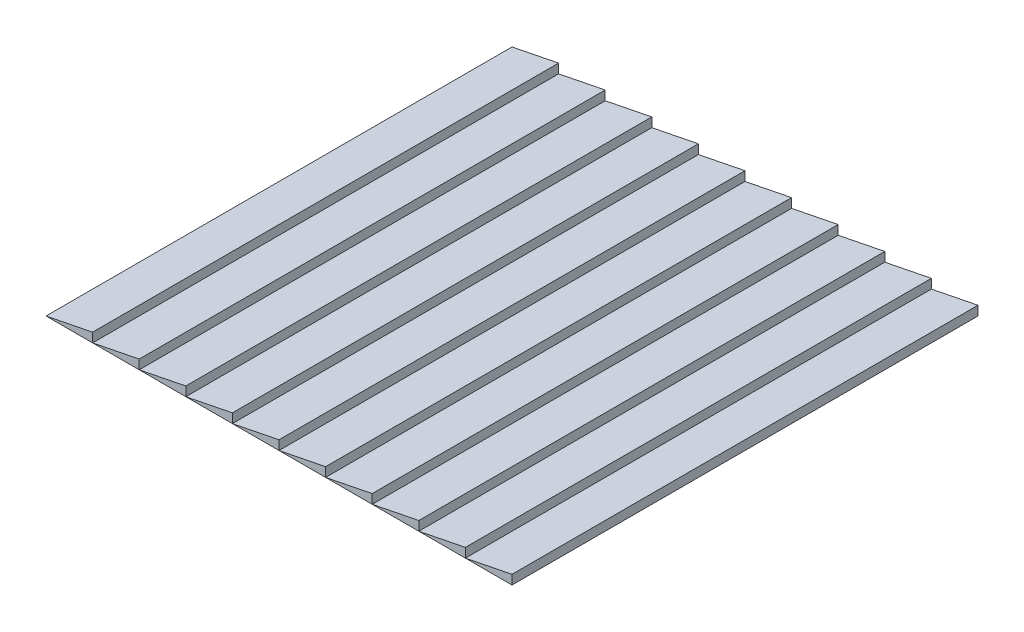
ISO-10303-21;
HEADER;
FILE_DESCRIPTION(('STEP AP214'),'2;1');
FILE_NAME('part.step','',(''),(''),'','','');
FILE_SCHEMA(('AUTOMOTIVE_DESIGN { 1 0 10303 214 1 1 1 1 }'));
ENDSEC;
DATA;
#1=APPLICATION_CONTEXT('core data for automotive mechanical design processes');
#2=APPLICATION_PROTOCOL_DEFINITION('international standard','automotive_design',2000,#1);
#3=PRODUCT_CONTEXT('',#1,'mechanical');
#4=PRODUCT('Part','Part','',(#3));
#5=PRODUCT_RELATED_PRODUCT_CATEGORY('part','',(#4));
#6=PRODUCT_DEFINITION_FORMATION('','',#4);
#7=PRODUCT_DEFINITION_CONTEXT('part definition',#1,'design');
#8=PRODUCT_DEFINITION('design','',#6,#7);
#9=PRODUCT_DEFINITION_SHAPE('','',#8);
#10=(LENGTH_UNIT() NAMED_UNIT(*) SI_UNIT(.MILLI.,.METRE.));
#11=(NAMED_UNIT(*) PLANE_ANGLE_UNIT() SI_UNIT($,.RADIAN.));
#12=(NAMED_UNIT(*) SI_UNIT($,.STERADIAN.) SOLID_ANGLE_UNIT());
#13=UNCERTAINTY_MEASURE_WITH_UNIT(LENGTH_MEASURE(1.E-05),#10,'distance_accuracy_value','');
#14=(GEOMETRIC_REPRESENTATION_CONTEXT(3) GLOBAL_UNCERTAINTY_ASSIGNED_CONTEXT((#13)) GLOBAL_UNIT_ASSIGNED_CONTEXT((#10,
#11,#12)) REPRESENTATION_CONTEXT('',''));
#15=CARTESIAN_POINT('',(0.,0.,0.));
#16=DIRECTION('',(0.,0.,1.));
#17=DIRECTION('',(1.,0.,0.));
#18=AXIS2_PLACEMENT_3D('',#15,#16,#17);
#19=CARTESIAN_POINT('',(-900.,-1.10218211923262E-13,-1000.));
#20=DIRECTION('',(1.,0.,0.));
#21=DIRECTION('',(0.,0.,-1.));
#22=AXIS2_PLACEMENT_3D('',#19,#20,#21);
#23=PLANE('',#22);
#24=DIRECTION('',(0.,1.,0.));
#25=VECTOR('',#24,1.);
#26=CARTESIAN_POINT('',(-900.,-1.10218211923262E-13,0.));
#27=LINE('',#26,#25);
#28=CARTESIAN_POINT('',(-900.,-1.10218211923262E-13,0.));
#29=VERTEX_POINT('',#28);
#30=CARTESIAN_POINT('',(-900.,19.9999999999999,0.));
#31=VERTEX_POINT('',#30);
#32=EDGE_CURVE('E102',#29,#31,#27,.T.);
#33=ORIENTED_EDGE('',*,*,#32,.F.);
#34=DIRECTION('',(0.,0.,1.));
#35=VECTOR('',#34,1.);
#36=CARTESIAN_POINT('',(-900.,-1.10218211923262E-13,-1000.));
#37=LINE('',#36,#35);
#38=CARTESIAN_POINT('',(-900.,-1.10218211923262E-13,-1000.));
#39=VERTEX_POINT('',#38);
#40=EDGE_CURVE('E12',#39,#29,#37,.T.);
#41=ORIENTED_EDGE('',*,*,#40,.F.);
#42=DIRECTION('',(0.,1.,0.));
#43=VECTOR('',#42,1.);
#44=CARTESIAN_POINT('',(-900.,-1.10218211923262E-13,-1000.));
#45=LINE('',#44,#43);
#46=CARTESIAN_POINT('',(-900.,19.9999999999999,-1000.));
#47=VERTEX_POINT('',#46);
#48=EDGE_CURVE('E95',#39,#47,#45,.T.);
#49=ORIENTED_EDGE('',*,*,#48,.T.);
#50=DIRECTION('',(0.,0.,1.));
#51=VECTOR('',#50,1.);
#52=CARTESIAN_POINT('',(-900.,19.9999999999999,-1000.));
#53=LINE('',#52,#51);
#54=EDGE_CURVE('E53',#47,#31,#53,.T.);
#55=ORIENTED_EDGE('',*,*,#54,.T.);
#56=EDGE_LOOP('',(#33,#41,#49,#55));
#57=FACE_BOUND('',#56,.T.);
#58=ADVANCED_FACE('F50',(#57),#23,.T.);
#59=CARTESIAN_POINT('',(-900.,-1.10218211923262E-13,-1000.));
#60=DIRECTION('',(0.,1.,0.));
#61=DIRECTION('',(-1.,0.,0.));
#62=AXIS2_PLACEMENT_3D('',#59,#60,#61);
#63=PLANE('',#62);
#64=DIRECTION('',(-1.,0.,0.));
#65=VECTOR('',#64,1.);
#66=CARTESIAN_POINT('',(-900.,-1.10218211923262E-13,0.));
#67=LINE('',#66,#65);
#68=CARTESIAN_POINT('',(-1000.,-1.22464679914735E-13,0.));
#69=VERTEX_POINT('',#68);
#70=EDGE_CURVE('E97',#29,#69,#67,.T.);
#71=ORIENTED_EDGE('',*,*,#70,.T.);
#72=DIRECTION('',(0.,0.,1.));
#73=VECTOR('',#72,1.);
#74=CARTESIAN_POINT('',(-1000.,-1.22464679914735E-13,-1000.));
#75=LINE('',#74,#73);
#76=CARTESIAN_POINT('',(-1000.,-1.22464679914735E-13,-1000.));
#77=VERTEX_POINT('',#76);
#78=EDGE_CURVE('E59',#77,#69,#75,.T.);
#79=ORIENTED_EDGE('',*,*,#78,.F.);
#80=DIRECTION('',(-1.,0.,0.));
#81=VECTOR('',#80,1.);
#82=CARTESIAN_POINT('',(-900.,-1.10218211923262E-13,-1000.));
#83=LINE('',#82,#81);
#84=EDGE_CURVE('E91',#39,#77,#83,.T.);
#85=ORIENTED_EDGE('',*,*,#84,.F.);
#86=ORIENTED_EDGE('',*,*,#40,.T.);
#87=EDGE_LOOP('',(#71,#79,#85,#86));
#88=FACE_BOUND('',#87,.T.);
#89=ADVANCED_FACE('F106',(#88),#63,.F.);
#90=CARTESIAN_POINT('',(-900.,19.9999999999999,-1000.));
#91=DIRECTION('',(-0.196116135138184,0.98058067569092,0.));
#92=DIRECTION('',(-0.98058067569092,-0.196116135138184,0.));
#93=AXIS2_PLACEMENT_3D('',#90,#91,#92);
#94=PLANE('',#93);
#95=DIRECTION('',(-0.98058067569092,-0.196116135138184,0.));
#96=VECTOR('',#95,1.);
#97=CARTESIAN_POINT('',(-900.,19.9999999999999,0.));
#98=LINE('',#97,#96);
#99=EDGE_CURVE('E89',#31,#69,#98,.T.);
#100=ORIENTED_EDGE('',*,*,#99,.F.);
#101=ORIENTED_EDGE('',*,*,#54,.F.);
#102=DIRECTION('',(-0.98058067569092,-0.196116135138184,0.));
#103=VECTOR('',#102,1.);
#104=CARTESIAN_POINT('',(-900.,19.9999999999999,-1000.));
#105=LINE('',#104,#103);
#106=EDGE_CURVE('E87',#47,#77,#105,.T.);
#107=ORIENTED_EDGE('',*,*,#106,.T.);
#108=ORIENTED_EDGE('',*,*,#78,.T.);
#109=EDGE_LOOP('',(#100,#101,#107,#108));
#110=FACE_BOUND('',#109,.T.);
#111=ADVANCED_FACE('F86',(#110),#94,.T.);
#112=CARTESIAN_POINT('',(-900.,-1.10218211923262E-13,-1000.));
#113=DIRECTION('',(0.,0.,1.));
#114=DIRECTION('',(1.,0.,0.));
#115=AXIS2_PLACEMENT_3D('',#112,#113,#114);
#116=PLANE('',#115);
#117=ORIENTED_EDGE('',*,*,#48,.F.);
#118=ORIENTED_EDGE('',*,*,#84,.T.);
#119=ORIENTED_EDGE('',*,*,#106,.F.);
#120=EDGE_LOOP('',(#117,#118,#119));
#121=FACE_BOUND('',#120,.T.);
#122=ADVANCED_FACE('F94',(#121),#116,.F.);
#123=CARTESIAN_POINT('',(-900.,-1.10218211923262E-13,0.));
#124=DIRECTION('',(0.,0.,1.));
#125=DIRECTION('',(1.,0.,0.));
#126=AXIS2_PLACEMENT_3D('',#123,#124,#125);
#127=PLANE('',#126);
#128=ORIENTED_EDGE('',*,*,#32,.T.);
#129=ORIENTED_EDGE('',*,*,#99,.T.);
#130=ORIENTED_EDGE('',*,*,#70,.F.);
#131=EDGE_LOOP('',(#128,#129,#130));
#132=FACE_BOUND('',#131,.T.);
#133=ADVANCED_FACE('F105',(#132),#127,.T.);
#134=CLOSED_SHELL('',(#58,#89,#111,#122,#133));
#135=MANIFOLD_SOLID_BREP('B2',#134);
#136=CARTESIAN_POINT('',(-800.,0.,-1000.));
#137=DIRECTION('',(1.,0.,0.));
#138=DIRECTION('',(0.,0.,-1.));
#139=AXIS2_PLACEMENT_3D('',#136,#137,#138);
#140=PLANE('',#139);
#141=DIRECTION('',(0.,1.,0.));
#142=VECTOR('',#141,1.);
#143=CARTESIAN_POINT('',(-800.,0.,0.));
#144=LINE('',#143,#142);
#145=CARTESIAN_POINT('',(-800.,0.,0.));
#146=VERTEX_POINT('',#145);
#147=CARTESIAN_POINT('',(-800.,19.9999999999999,0.));
#148=VERTEX_POINT('',#147);
#149=EDGE_CURVE('E230',#146,#148,#144,.T.);
#150=ORIENTED_EDGE('',*,*,#149,.F.);
#151=DIRECTION('',(0.,0.,1.));
#152=VECTOR('',#151,1.);
#153=CARTESIAN_POINT('',(-800.,0.,-1000.));
#154=LINE('',#153,#152);
#155=CARTESIAN_POINT('',(-800.,0.,-1000.));
#156=VERTEX_POINT('',#155);
#157=EDGE_CURVE('E48',#156,#146,#154,.T.);
#158=ORIENTED_EDGE('',*,*,#157,.F.);
#159=DIRECTION('',(0.,1.,0.));
#160=VECTOR('',#159,1.);
#161=CARTESIAN_POINT('',(-800.,0.,-1000.));
#162=LINE('',#161,#160);
#163=CARTESIAN_POINT('',(-800.,19.9999999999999,-1000.));
#164=VERTEX_POINT('',#163);
#165=EDGE_CURVE('E223',#156,#164,#162,.T.);
#166=ORIENTED_EDGE('',*,*,#165,.T.);
#167=DIRECTION('',(0.,0.,1.));
#168=VECTOR('',#167,1.);
#169=CARTESIAN_POINT('',(-800.,19.9999999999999,-1000.));
#170=LINE('',#169,#168);
#171=EDGE_CURVE('E181',#164,#148,#170,.T.);
#172=ORIENTED_EDGE('',*,*,#171,.T.);
#173=EDGE_LOOP('',(#150,#158,#166,#172));
#174=FACE_BOUND('',#173,.T.);
#175=ADVANCED_FACE('F178',(#174),#140,.T.);
#176=CARTESIAN_POINT('',(-800.,0.,-1000.));
#177=DIRECTION('',(0.,1.,0.));
#178=DIRECTION('',(-1.,0.,0.));
#179=AXIS2_PLACEMENT_3D('',#176,#177,#178);
#180=PLANE('',#179);
#181=DIRECTION('',(-1.,0.,0.));
#182=VECTOR('',#181,1.);
#183=CARTESIAN_POINT('',(-800.,0.,0.));
#184=LINE('',#183,#182);
#185=CARTESIAN_POINT('',(-900.,-1.10218211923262E-13,0.));
#186=VERTEX_POINT('',#185);
#187=EDGE_CURVE('E225',#146,#186,#184,.T.);
#188=ORIENTED_EDGE('',*,*,#187,.T.);
#189=DIRECTION('',(0.,0.,1.));
#190=VECTOR('',#189,1.);
#191=CARTESIAN_POINT('',(-900.,-1.10218211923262E-13,-1000.));
#192=LINE('',#191,#190);
#193=CARTESIAN_POINT('',(-900.,-1.10218211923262E-13,-1000.));
#194=VERTEX_POINT('',#193);
#195=EDGE_CURVE('E187',#194,#186,#192,.T.);
#196=ORIENTED_EDGE('',*,*,#195,.F.);
#197=DIRECTION('',(-1.,0.,0.));
#198=VECTOR('',#197,1.);
#199=CARTESIAN_POINT('',(-800.,0.,-1000.));
#200=LINE('',#199,#198);
#201=EDGE_CURVE('E219',#156,#194,#200,.T.);
#202=ORIENTED_EDGE('',*,*,#201,.F.);
#203=ORIENTED_EDGE('',*,*,#157,.T.);
#204=EDGE_LOOP('',(#188,#196,#202,#203));
#205=FACE_BOUND('',#204,.T.);
#206=ADVANCED_FACE('F234',(#205),#180,.F.);
#207=CARTESIAN_POINT('',(-800.,19.9999999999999,-1000.));
#208=DIRECTION('',(-0.196116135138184,0.98058067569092,0.));
#209=DIRECTION('',(-0.98058067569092,-0.196116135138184,0.));
#210=AXIS2_PLACEMENT_3D('',#207,#208,#209);
#211=PLANE('',#210);
#212=DIRECTION('',(-0.98058067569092,-0.196116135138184,0.));
#213=VECTOR('',#212,1.);
#214=CARTESIAN_POINT('',(-800.,19.9999999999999,0.));
#215=LINE('',#214,#213);
#216=EDGE_CURVE('E217',#148,#186,#215,.T.);
#217=ORIENTED_EDGE('',*,*,#216,.F.);
#218=ORIENTED_EDGE('',*,*,#171,.F.);
#219=DIRECTION('',(-0.98058067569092,-0.196116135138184,0.));
#220=VECTOR('',#219,1.);
#221=CARTESIAN_POINT('',(-800.,19.9999999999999,-1000.));
#222=LINE('',#221,#220);
#223=EDGE_CURVE('E215',#164,#194,#222,.T.);
#224=ORIENTED_EDGE('',*,*,#223,.T.);
#225=ORIENTED_EDGE('',*,*,#195,.T.);
#226=EDGE_LOOP('',(#217,#218,#224,#225));
#227=FACE_BOUND('',#226,.T.);
#228=ADVANCED_FACE('F214',(#227),#211,.T.);
#229=CARTESIAN_POINT('',(-800.,0.,-1000.));
#230=DIRECTION('',(0.,0.,1.));
#231=DIRECTION('',(1.,0.,0.));
#232=AXIS2_PLACEMENT_3D('',#229,#230,#231);
#233=PLANE('',#232);
#234=ORIENTED_EDGE('',*,*,#165,.F.);
#235=ORIENTED_EDGE('',*,*,#201,.T.);
#236=ORIENTED_EDGE('',*,*,#223,.F.);
#237=EDGE_LOOP('',(#234,#235,#236));
#238=FACE_BOUND('',#237,.T.);
#239=ADVANCED_FACE('F222',(#238),#233,.F.);
#240=CARTESIAN_POINT('',(-800.,0.,0.));
#241=DIRECTION('',(0.,0.,1.));
#242=DIRECTION('',(1.,0.,0.));
#243=AXIS2_PLACEMENT_3D('',#240,#241,#242);
#244=PLANE('',#243);
#245=ORIENTED_EDGE('',*,*,#149,.T.);
#246=ORIENTED_EDGE('',*,*,#216,.T.);
#247=ORIENTED_EDGE('',*,*,#187,.F.);
#248=EDGE_LOOP('',(#245,#246,#247));
#249=FACE_BOUND('',#248,.T.);
#250=ADVANCED_FACE('F233',(#249),#244,.T.);
#251=CLOSED_SHELL('',(#175,#206,#228,#239,#250));
#252=MANIFOLD_SOLID_BREP('B6',#251);
#253=CARTESIAN_POINT('',(-700.,0.,-1000.));
#254=DIRECTION('',(1.,0.,0.));
#255=DIRECTION('',(0.,0.,-1.));
#256=AXIS2_PLACEMENT_3D('',#253,#254,#255);
#257=PLANE('',#256);
#258=DIRECTION('',(0.,1.,0.));
#259=VECTOR('',#258,1.);
#260=CARTESIAN_POINT('',(-700.,0.,0.));
#261=LINE('',#260,#259);
#262=CARTESIAN_POINT('',(-700.,0.,0.));
#263=VERTEX_POINT('',#262);
#264=CARTESIAN_POINT('',(-700.,19.9999999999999,0.));
#265=VERTEX_POINT('',#264);
#266=EDGE_CURVE('E358',#263,#265,#261,.T.);
#267=ORIENTED_EDGE('',*,*,#266,.F.);
#268=DIRECTION('',(0.,0.,1.));
#269=VECTOR('',#268,1.);
#270=CARTESIAN_POINT('',(-700.,0.,-1000.));
#271=LINE('',#270,#269);
#272=CARTESIAN_POINT('',(-700.,0.,-1000.));
#273=VERTEX_POINT('',#272);
#274=EDGE_CURVE('E176',#273,#263,#271,.T.);
#275=ORIENTED_EDGE('',*,*,#274,.F.);
#276=DIRECTION('',(0.,1.,0.));
#277=VECTOR('',#276,1.);
#278=CARTESIAN_POINT('',(-700.,0.,-1000.));
#279=LINE('',#278,#277);
#280=CARTESIAN_POINT('',(-700.,19.9999999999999,-1000.));
#281=VERTEX_POINT('',#280);
#282=EDGE_CURVE('E351',#273,#281,#279,.T.);
#283=ORIENTED_EDGE('',*,*,#282,.T.);
#284=DIRECTION('',(0.,0.,1.));
#285=VECTOR('',#284,1.);
#286=CARTESIAN_POINT('',(-700.,19.9999999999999,-1000.));
#287=LINE('',#286,#285);
#288=EDGE_CURVE('E309',#281,#265,#287,.T.);
#289=ORIENTED_EDGE('',*,*,#288,.T.);
#290=EDGE_LOOP('',(#267,#275,#283,#289));
#291=FACE_BOUND('',#290,.T.);
#292=ADVANCED_FACE('F306',(#291),#257,.T.);
#293=CARTESIAN_POINT('',(-700.,0.,-1000.));
#294=DIRECTION('',(0.,1.,0.));
#295=DIRECTION('',(-1.,0.,0.));
#296=AXIS2_PLACEMENT_3D('',#293,#294,#295);
#297=PLANE('',#296);
#298=DIRECTION('',(-1.,0.,0.));
#299=VECTOR('',#298,1.);
#300=CARTESIAN_POINT('',(-700.,0.,0.));
#301=LINE('',#300,#299);
#302=CARTESIAN_POINT('',(-800.,0.,0.));
#303=VERTEX_POINT('',#302);
#304=EDGE_CURVE('E353',#263,#303,#301,.T.);
#305=ORIENTED_EDGE('',*,*,#304,.T.);
#306=DIRECTION('',(0.,0.,1.));
#307=VECTOR('',#306,1.);
#308=CARTESIAN_POINT('',(-800.,0.,-1000.));
#309=LINE('',#308,#307);
#310=CARTESIAN_POINT('',(-800.,0.,-1000.));
#311=VERTEX_POINT('',#310);
#312=EDGE_CURVE('E315',#311,#303,#309,.T.);
#313=ORIENTED_EDGE('',*,*,#312,.F.);
#314=DIRECTION('',(-1.,0.,0.));
#315=VECTOR('',#314,1.);
#316=CARTESIAN_POINT('',(-700.,0.,-1000.));
#317=LINE('',#316,#315);
#318=EDGE_CURVE('E347',#273,#311,#317,.T.);
#319=ORIENTED_EDGE('',*,*,#318,.F.);
#320=ORIENTED_EDGE('',*,*,#274,.T.);
#321=EDGE_LOOP('',(#305,#313,#319,#320));
#322=FACE_BOUND('',#321,.T.);
#323=ADVANCED_FACE('F362',(#322),#297,.F.);
#324=CARTESIAN_POINT('',(-700.,19.9999999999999,-1000.));
#325=DIRECTION('',(-0.196116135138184,0.98058067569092,0.));
#326=DIRECTION('',(-0.98058067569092,-0.196116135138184,0.));
#327=AXIS2_PLACEMENT_3D('',#324,#325,#326);
#328=PLANE('',#327);
#329=DIRECTION('',(-0.98058067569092,-0.196116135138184,0.));
#330=VECTOR('',#329,1.);
#331=CARTESIAN_POINT('',(-700.,19.9999999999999,0.));
#332=LINE('',#331,#330);
#333=EDGE_CURVE('E345',#265,#303,#332,.T.);
#334=ORIENTED_EDGE('',*,*,#333,.F.);
#335=ORIENTED_EDGE('',*,*,#288,.F.);
#336=DIRECTION('',(-0.98058067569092,-0.196116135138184,0.));
#337=VECTOR('',#336,1.);
#338=CARTESIAN_POINT('',(-700.,19.9999999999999,-1000.));
#339=LINE('',#338,#337);
#340=EDGE_CURVE('E343',#281,#311,#339,.T.);
#341=ORIENTED_EDGE('',*,*,#340,.T.);
#342=ORIENTED_EDGE('',*,*,#312,.T.);
#343=EDGE_LOOP('',(#334,#335,#341,#342));
#344=FACE_BOUND('',#343,.T.);
#345=ADVANCED_FACE('F342',(#344),#328,.T.);
#346=CARTESIAN_POINT('',(-700.,0.,-1000.));
#347=DIRECTION('',(0.,0.,1.));
#348=DIRECTION('',(1.,0.,0.));
#349=AXIS2_PLACEMENT_3D('',#346,#347,#348);
#350=PLANE('',#349);
#351=ORIENTED_EDGE('',*,*,#282,.F.);
#352=ORIENTED_EDGE('',*,*,#318,.T.);
#353=ORIENTED_EDGE('',*,*,#340,.F.);
#354=EDGE_LOOP('',(#351,#352,#353));
#355=FACE_BOUND('',#354,.T.);
#356=ADVANCED_FACE('F350',(#355),#350,.F.);
#357=CARTESIAN_POINT('',(-700.,0.,0.));
#358=DIRECTION('',(0.,0.,1.));
#359=DIRECTION('',(1.,0.,0.));
#360=AXIS2_PLACEMENT_3D('',#357,#358,#359);
#361=PLANE('',#360);
#362=ORIENTED_EDGE('',*,*,#266,.T.);
#363=ORIENTED_EDGE('',*,*,#333,.T.);
#364=ORIENTED_EDGE('',*,*,#304,.F.);
#365=EDGE_LOOP('',(#362,#363,#364));
#366=FACE_BOUND('',#365,.T.);
#367=ADVANCED_FACE('F361',(#366),#361,.T.);
#368=CLOSED_SHELL('',(#292,#323,#345,#356,#367));
#369=MANIFOLD_SOLID_BREP('B42',#368);
#370=CARTESIAN_POINT('',(-600.,0.,-1000.));
#371=DIRECTION('',(1.,0.,0.));
#372=DIRECTION('',(0.,0.,-1.));
#373=AXIS2_PLACEMENT_3D('',#370,#371,#372);
#374=PLANE('',#373);
#375=DIRECTION('',(0.,1.,0.));
#376=VECTOR('',#375,1.);
#377=CARTESIAN_POINT('',(-600.,0.,0.));
#378=LINE('',#377,#376);
#379=CARTESIAN_POINT('',(-600.,0.,0.));
#380=VERTEX_POINT('',#379);
#381=CARTESIAN_POINT('',(-600.,19.9999999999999,0.));
#382=VERTEX_POINT('',#381);
#383=EDGE_CURVE('E486',#380,#382,#378,.T.);
#384=ORIENTED_EDGE('',*,*,#383,.F.);
#385=DIRECTION('',(0.,0.,1.));
#386=VECTOR('',#385,1.);
#387=CARTESIAN_POINT('',(-600.,0.,-1000.));
#388=LINE('',#387,#386);
#389=CARTESIAN_POINT('',(-600.,0.,-1000.));
#390=VERTEX_POINT('',#389);
#391=EDGE_CURVE('E304',#390,#380,#388,.T.);
#392=ORIENTED_EDGE('',*,*,#391,.F.);
#393=DIRECTION('',(0.,1.,0.));
#394=VECTOR('',#393,1.);
#395=CARTESIAN_POINT('',(-600.,0.,-1000.));
#396=LINE('',#395,#394);
#397=CARTESIAN_POINT('',(-600.,19.9999999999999,-1000.));
#398=VERTEX_POINT('',#397);
#399=EDGE_CURVE('E479',#390,#398,#396,.T.);
#400=ORIENTED_EDGE('',*,*,#399,.T.);
#401=DIRECTION('',(0.,0.,1.));
#402=VECTOR('',#401,1.);
#403=CARTESIAN_POINT('',(-600.,19.9999999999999,-1000.));
#404=LINE('',#403,#402);
#405=EDGE_CURVE('E437',#398,#382,#404,.T.);
#406=ORIENTED_EDGE('',*,*,#405,.T.);
#407=EDGE_LOOP('',(#384,#392,#400,#406));
#408=FACE_BOUND('',#407,.T.);
#409=ADVANCED_FACE('F434',(#408),#374,.T.);
#410=CARTESIAN_POINT('',(-600.,0.,-1000.));
#411=DIRECTION('',(0.,1.,0.));
#412=DIRECTION('',(-1.,0.,0.));
#413=AXIS2_PLACEMENT_3D('',#410,#411,#412);
#414=PLANE('',#413);
#415=DIRECTION('',(-1.,0.,0.));
#416=VECTOR('',#415,1.);
#417=CARTESIAN_POINT('',(-600.,0.,0.));
#418=LINE('',#417,#416);
#419=CARTESIAN_POINT('',(-700.,0.,0.));
#420=VERTEX_POINT('',#419);
#421=EDGE_CURVE('E481',#380,#420,#418,.T.);
#422=ORIENTED_EDGE('',*,*,#421,.T.);
#423=DIRECTION('',(0.,0.,1.));
#424=VECTOR('',#423,1.);
#425=CARTESIAN_POINT('',(-700.,0.,-1000.));
#426=LINE('',#425,#424);
#427=CARTESIAN_POINT('',(-700.,0.,-1000.));
#428=VERTEX_POINT('',#427);
#429=EDGE_CURVE('E443',#428,#420,#426,.T.);
#430=ORIENTED_EDGE('',*,*,#429,.F.);
#431=DIRECTION('',(-1.,0.,0.));
#432=VECTOR('',#431,1.);
#433=CARTESIAN_POINT('',(-600.,0.,-1000.));
#434=LINE('',#433,#432);
#435=EDGE_CURVE('E475',#390,#428,#434,.T.);
#436=ORIENTED_EDGE('',*,*,#435,.F.);
#437=ORIENTED_EDGE('',*,*,#391,.T.);
#438=EDGE_LOOP('',(#422,#430,#436,#437));
#439=FACE_BOUND('',#438,.T.);
#440=ADVANCED_FACE('F490',(#439),#414,.F.);
#441=CARTESIAN_POINT('',(-600.,19.9999999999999,-1000.));
#442=DIRECTION('',(-0.196116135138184,0.98058067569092,0.));
#443=DIRECTION('',(-0.98058067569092,-0.196116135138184,0.));
#444=AXIS2_PLACEMENT_3D('',#441,#442,#443);
#445=PLANE('',#444);
#446=DIRECTION('',(-0.98058067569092,-0.196116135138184,0.));
#447=VECTOR('',#446,1.);
#448=CARTESIAN_POINT('',(-600.,19.9999999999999,0.));
#449=LINE('',#448,#447);
#450=EDGE_CURVE('E473',#382,#420,#449,.T.);
#451=ORIENTED_EDGE('',*,*,#450,.F.);
#452=ORIENTED_EDGE('',*,*,#405,.F.);
#453=DIRECTION('',(-0.98058067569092,-0.196116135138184,0.));
#454=VECTOR('',#453,1.);
#455=CARTESIAN_POINT('',(-600.,19.9999999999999,-1000.));
#456=LINE('',#455,#454);
#457=EDGE_CURVE('E471',#398,#428,#456,.T.);
#458=ORIENTED_EDGE('',*,*,#457,.T.);
#459=ORIENTED_EDGE('',*,*,#429,.T.);
#460=EDGE_LOOP('',(#451,#452,#458,#459));
#461=FACE_BOUND('',#460,.T.);
#462=ADVANCED_FACE('F470',(#461),#445,.T.);
#463=CARTESIAN_POINT('',(-600.,0.,-1000.));
#464=DIRECTION('',(0.,0.,1.));
#465=DIRECTION('',(1.,0.,0.));
#466=AXIS2_PLACEMENT_3D('',#463,#464,#465);
#467=PLANE('',#466);
#468=ORIENTED_EDGE('',*,*,#399,.F.);
#469=ORIENTED_EDGE('',*,*,#435,.T.);
#470=ORIENTED_EDGE('',*,*,#457,.F.);
#471=EDGE_LOOP('',(#468,#469,#470));
#472=FACE_BOUND('',#471,.T.);
#473=ADVANCED_FACE('F478',(#472),#467,.F.);
#474=CARTESIAN_POINT('',(-600.,0.,0.));
#475=DIRECTION('',(0.,0.,1.));
#476=DIRECTION('',(1.,0.,0.));
#477=AXIS2_PLACEMENT_3D('',#474,#475,#476);
#478=PLANE('',#477);
#479=ORIENTED_EDGE('',*,*,#383,.T.);
#480=ORIENTED_EDGE('',*,*,#450,.T.);
#481=ORIENTED_EDGE('',*,*,#421,.F.);
#482=EDGE_LOOP('',(#479,#480,#481));
#483=FACE_BOUND('',#482,.T.);
#484=ADVANCED_FACE('F489',(#483),#478,.T.);
#485=CLOSED_SHELL('',(#409,#440,#462,#473,#484));
#486=MANIFOLD_SOLID_BREP('B170',#485);
#487=CARTESIAN_POINT('',(-500.,0.,-1000.));
#488=DIRECTION('',(1.,0.,0.));
#489=DIRECTION('',(0.,0.,-1.));
#490=AXIS2_PLACEMENT_3D('',#487,#488,#489);
#491=PLANE('',#490);
#492=DIRECTION('',(0.,1.,0.));
#493=VECTOR('',#492,1.);
#494=CARTESIAN_POINT('',(-500.,0.,0.));
#495=LINE('',#494,#493);
#496=CARTESIAN_POINT('',(-500.,0.,0.));
#497=VERTEX_POINT('',#496);
#498=CARTESIAN_POINT('',(-500.,19.9999999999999,0.));
#499=VERTEX_POINT('',#498);
#500=EDGE_CURVE('E614',#497,#499,#495,.T.);
#501=ORIENTED_EDGE('',*,*,#500,.F.);
#502=DIRECTION('',(0.,0.,1.));
#503=VECTOR('',#502,1.);
#504=CARTESIAN_POINT('',(-500.,0.,-1000.));
#505=LINE('',#504,#503);
#506=CARTESIAN_POINT('',(-500.,0.,-1000.));
#507=VERTEX_POINT('',#506);
#508=EDGE_CURVE('E432',#507,#497,#505,.T.);
#509=ORIENTED_EDGE('',*,*,#508,.F.);
#510=DIRECTION('',(0.,1.,0.));
#511=VECTOR('',#510,1.);
#512=CARTESIAN_POINT('',(-500.,0.,-1000.));
#513=LINE('',#512,#511);
#514=CARTESIAN_POINT('',(-500.,19.9999999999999,-1000.));
#515=VERTEX_POINT('',#514);
#516=EDGE_CURVE('E607',#507,#515,#513,.T.);
#517=ORIENTED_EDGE('',*,*,#516,.T.);
#518=DIRECTION('',(0.,0.,1.));
#519=VECTOR('',#518,1.);
#520=CARTESIAN_POINT('',(-500.,19.9999999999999,-1000.));
#521=LINE('',#520,#519);
#522=EDGE_CURVE('E565',#515,#499,#521,.T.);
#523=ORIENTED_EDGE('',*,*,#522,.T.);
#524=EDGE_LOOP('',(#501,#509,#517,#523));
#525=FACE_BOUND('',#524,.T.);
#526=ADVANCED_FACE('F562',(#525),#491,.T.);
#527=CARTESIAN_POINT('',(-500.,0.,-1000.));
#528=DIRECTION('',(0.,1.,0.));
#529=DIRECTION('',(-1.,0.,0.));
#530=AXIS2_PLACEMENT_3D('',#527,#528,#529);
#531=PLANE('',#530);
#532=DIRECTION('',(-1.,0.,0.));
#533=VECTOR('',#532,1.);
#534=CARTESIAN_POINT('',(-500.,0.,0.));
#535=LINE('',#534,#533);
#536=CARTESIAN_POINT('',(-600.,0.,0.));
#537=VERTEX_POINT('',#536);
#538=EDGE_CURVE('E609',#497,#537,#535,.T.);
#539=ORIENTED_EDGE('',*,*,#538,.T.);
#540=DIRECTION('',(0.,0.,1.));
#541=VECTOR('',#540,1.);
#542=CARTESIAN_POINT('',(-600.,0.,-1000.));
#543=LINE('',#542,#541);
#544=CARTESIAN_POINT('',(-600.,0.,-1000.));
#545=VERTEX_POINT('',#544);
#546=EDGE_CURVE('E571',#545,#537,#543,.T.);
#547=ORIENTED_EDGE('',*,*,#546,.F.);
#548=DIRECTION('',(-1.,0.,0.));
#549=VECTOR('',#548,1.);
#550=CARTESIAN_POINT('',(-500.,0.,-1000.));
#551=LINE('',#550,#549);
#552=EDGE_CURVE('E603',#507,#545,#551,.T.);
#553=ORIENTED_EDGE('',*,*,#552,.F.);
#554=ORIENTED_EDGE('',*,*,#508,.T.);
#555=EDGE_LOOP('',(#539,#547,#553,#554));
#556=FACE_BOUND('',#555,.T.);
#557=ADVANCED_FACE('F618',(#556),#531,.F.);
#558=CARTESIAN_POINT('',(-500.,19.9999999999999,-1000.));
#559=DIRECTION('',(-0.196116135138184,0.98058067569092,0.));
#560=DIRECTION('',(-0.98058067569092,-0.196116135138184,0.));
#561=AXIS2_PLACEMENT_3D('',#558,#559,#560);
#562=PLANE('',#561);
#563=DIRECTION('',(-0.98058067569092,-0.196116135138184,0.));
#564=VECTOR('',#563,1.);
#565=CARTESIAN_POINT('',(-500.,19.9999999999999,0.));
#566=LINE('',#565,#564);
#567=EDGE_CURVE('E601',#499,#537,#566,.T.);
#568=ORIENTED_EDGE('',*,*,#567,.F.);
#569=ORIENTED_EDGE('',*,*,#522,.F.);
#570=DIRECTION('',(-0.98058067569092,-0.196116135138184,0.));
#571=VECTOR('',#570,1.);
#572=CARTESIAN_POINT('',(-500.,19.9999999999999,-1000.));
#573=LINE('',#572,#571);
#574=EDGE_CURVE('E599',#515,#545,#573,.T.);
#575=ORIENTED_EDGE('',*,*,#574,.T.);
#576=ORIENTED_EDGE('',*,*,#546,.T.);
#577=EDGE_LOOP('',(#568,#569,#575,#576));
#578=FACE_BOUND('',#577,.T.);
#579=ADVANCED_FACE('F598',(#578),#562,.T.);
#580=CARTESIAN_POINT('',(-500.,0.,-1000.));
#581=DIRECTION('',(0.,0.,1.));
#582=DIRECTION('',(1.,0.,0.));
#583=AXIS2_PLACEMENT_3D('',#580,#581,#582);
#584=PLANE('',#583);
#585=ORIENTED_EDGE('',*,*,#516,.F.);
#586=ORIENTED_EDGE('',*,*,#552,.T.);
#587=ORIENTED_EDGE('',*,*,#574,.F.);
#588=EDGE_LOOP('',(#585,#586,#587));
#589=FACE_BOUND('',#588,.T.);
#590=ADVANCED_FACE('F606',(#589),#584,.F.);
#591=CARTESIAN_POINT('',(-500.,0.,0.));
#592=DIRECTION('',(0.,0.,1.));
#593=DIRECTION('',(1.,0.,0.));
#594=AXIS2_PLACEMENT_3D('',#591,#592,#593);
#595=PLANE('',#594);
#596=ORIENTED_EDGE('',*,*,#500,.T.);
#597=ORIENTED_EDGE('',*,*,#567,.T.);
#598=ORIENTED_EDGE('',*,*,#538,.F.);
#599=EDGE_LOOP('',(#596,#597,#598));
#600=FACE_BOUND('',#599,.T.);
#601=ADVANCED_FACE('F617',(#600),#595,.T.);
#602=CLOSED_SHELL('',(#526,#557,#579,#590,#601));
#603=MANIFOLD_SOLID_BREP('B298',#602);
#604=CARTESIAN_POINT('',(-400.,0.,-1000.));
#605=DIRECTION('',(1.,0.,0.));
#606=DIRECTION('',(0.,0.,-1.));
#607=AXIS2_PLACEMENT_3D('',#604,#605,#606);
#608=PLANE('',#607);
#609=DIRECTION('',(0.,1.,0.));
#610=VECTOR('',#609,1.);
#611=CARTESIAN_POINT('',(-400.,0.,0.));
#612=LINE('',#611,#610);
#613=CARTESIAN_POINT('',(-400.,0.,0.));
#614=VERTEX_POINT('',#613);
#615=CARTESIAN_POINT('',(-400.,20.,0.));
#616=VERTEX_POINT('',#615);
#617=EDGE_CURVE('E742',#614,#616,#612,.T.);
#618=ORIENTED_EDGE('',*,*,#617,.F.);
#619=DIRECTION('',(0.,0.,1.));
#620=VECTOR('',#619,1.);
#621=CARTESIAN_POINT('',(-400.,0.,-1000.));
#622=LINE('',#621,#620);
#623=CARTESIAN_POINT('',(-400.,0.,-1000.));
#624=VERTEX_POINT('',#623);
#625=EDGE_CURVE('E560',#624,#614,#622,.T.);
#626=ORIENTED_EDGE('',*,*,#625,.F.);
#627=DIRECTION('',(0.,1.,0.));
#628=VECTOR('',#627,1.);
#629=CARTESIAN_POINT('',(-400.,0.,-1000.));
#630=LINE('',#629,#628);
#631=CARTESIAN_POINT('',(-400.,20.,-1000.));
#632=VERTEX_POINT('',#631);
#633=EDGE_CURVE('E735',#624,#632,#630,.T.);
#634=ORIENTED_EDGE('',*,*,#633,.T.);
#635=DIRECTION('',(0.,0.,1.));
#636=VECTOR('',#635,1.);
#637=CARTESIAN_POINT('',(-400.,20.,-1000.));
#638=LINE('',#637,#636);
#639=EDGE_CURVE('E693',#632,#616,#638,.T.);
#640=ORIENTED_EDGE('',*,*,#639,.T.);
#641=EDGE_LOOP('',(#618,#626,#634,#640));
#642=FACE_BOUND('',#641,.T.);
#643=ADVANCED_FACE('F690',(#642),#608,.T.);
#644=CARTESIAN_POINT('',(-400.,0.,-1000.));
#645=DIRECTION('',(0.,1.,0.));
#646=DIRECTION('',(-1.,0.,0.));
#647=AXIS2_PLACEMENT_3D('',#644,#645,#646);
#648=PLANE('',#647);
#649=DIRECTION('',(-1.,0.,0.));
#650=VECTOR('',#649,1.);
#651=CARTESIAN_POINT('',(-400.,0.,0.));
#652=LINE('',#651,#650);
#653=CARTESIAN_POINT('',(-500.,0.,0.));
#654=VERTEX_POINT('',#653);
#655=EDGE_CURVE('E737',#614,#654,#652,.T.);
#656=ORIENTED_EDGE('',*,*,#655,.T.);
#657=DIRECTION('',(0.,0.,1.));
#658=VECTOR('',#657,1.);
#659=CARTESIAN_POINT('',(-500.,0.,-1000.));
#660=LINE('',#659,#658);
#661=CARTESIAN_POINT('',(-500.,0.,-1000.));
#662=VERTEX_POINT('',#661);
#663=EDGE_CURVE('E699',#662,#654,#660,.T.);
#664=ORIENTED_EDGE('',*,*,#663,.F.);
#665=DIRECTION('',(-1.,0.,0.));
#666=VECTOR('',#665,1.);
#667=CARTESIAN_POINT('',(-400.,0.,-1000.));
#668=LINE('',#667,#666);
#669=EDGE_CURVE('E731',#624,#662,#668,.T.);
#670=ORIENTED_EDGE('',*,*,#669,.F.);
#671=ORIENTED_EDGE('',*,*,#625,.T.);
#672=EDGE_LOOP('',(#656,#664,#670,#671));
#673=FACE_BOUND('',#672,.T.);
#674=ADVANCED_FACE('F746',(#673),#648,.F.);
#675=CARTESIAN_POINT('',(-400.,20.,-1000.));
#676=DIRECTION('',(-0.196116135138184,0.98058067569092,0.));
#677=DIRECTION('',(-0.98058067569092,-0.196116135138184,0.));
#678=AXIS2_PLACEMENT_3D('',#675,#676,#677);
#679=PLANE('',#678);
#680=DIRECTION('',(-0.98058067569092,-0.196116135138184,0.));
#681=VECTOR('',#680,1.);
#682=CARTESIAN_POINT('',(-400.,20.,0.));
#683=LINE('',#682,#681);
#684=EDGE_CURVE('E729',#616,#654,#683,.T.);
#685=ORIENTED_EDGE('',*,*,#684,.F.);
#686=ORIENTED_EDGE('',*,*,#639,.F.);
#687=DIRECTION('',(-0.98058067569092,-0.196116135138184,0.));
#688=VECTOR('',#687,1.);
#689=CARTESIAN_POINT('',(-400.,20.,-1000.));
#690=LINE('',#689,#688);
#691=EDGE_CURVE('E727',#632,#662,#690,.T.);
#692=ORIENTED_EDGE('',*,*,#691,.T.);
#693=ORIENTED_EDGE('',*,*,#663,.T.);
#694=EDGE_LOOP('',(#685,#686,#692,#693));
#695=FACE_BOUND('',#694,.T.);
#696=ADVANCED_FACE('F726',(#695),#679,.T.);
#697=CARTESIAN_POINT('',(-400.,0.,-1000.));
#698=DIRECTION('',(0.,0.,1.));
#699=DIRECTION('',(1.,0.,0.));
#700=AXIS2_PLACEMENT_3D('',#697,#698,#699);
#701=PLANE('',#700);
#702=ORIENTED_EDGE('',*,*,#633,.F.);
#703=ORIENTED_EDGE('',*,*,#669,.T.);
#704=ORIENTED_EDGE('',*,*,#691,.F.);
#705=EDGE_LOOP('',(#702,#703,#704));
#706=FACE_BOUND('',#705,.T.);
#707=ADVANCED_FACE('F734',(#706),#701,.F.);
#708=CARTESIAN_POINT('',(-400.,0.,0.));
#709=DIRECTION('',(0.,0.,1.));
#710=DIRECTION('',(1.,0.,0.));
#711=AXIS2_PLACEMENT_3D('',#708,#709,#710);
#712=PLANE('',#711);
#713=ORIENTED_EDGE('',*,*,#617,.T.);
#714=ORIENTED_EDGE('',*,*,#684,.T.);
#715=ORIENTED_EDGE('',*,*,#655,.F.);
#716=EDGE_LOOP('',(#713,#714,#715));
#717=FACE_BOUND('',#716,.T.);
#718=ADVANCED_FACE('F745',(#717),#712,.T.);
#719=CLOSED_SHELL('',(#643,#674,#696,#707,#718));
#720=MANIFOLD_SOLID_BREP('B426',#719);
#721=CARTESIAN_POINT('',(-300.,0.,-1000.));
#722=DIRECTION('',(1.,0.,0.));
#723=DIRECTION('',(0.,0.,-1.));
#724=AXIS2_PLACEMENT_3D('',#721,#722,#723);
#725=PLANE('',#724);
#726=DIRECTION('',(0.,1.,0.));
#727=VECTOR('',#726,1.);
#728=CARTESIAN_POINT('',(-300.,0.,0.));
#729=LINE('',#728,#727);
#730=CARTESIAN_POINT('',(-300.,0.,0.));
#731=VERTEX_POINT('',#730);
#732=CARTESIAN_POINT('',(-300.,20.,0.));
#733=VERTEX_POINT('',#732);
#734=EDGE_CURVE('E870',#731,#733,#729,.T.);
#735=ORIENTED_EDGE('',*,*,#734,.F.);
#736=DIRECTION('',(0.,0.,1.));
#737=VECTOR('',#736,1.);
#738=CARTESIAN_POINT('',(-300.,0.,-1000.));
#739=LINE('',#738,#737);
#740=CARTESIAN_POINT('',(-300.,0.,-1000.));
#741=VERTEX_POINT('',#740);
#742=EDGE_CURVE('E688',#741,#731,#739,.T.);
#743=ORIENTED_EDGE('',*,*,#742,.F.);
#744=DIRECTION('',(0.,1.,0.));
#745=VECTOR('',#744,1.);
#746=CARTESIAN_POINT('',(-300.,0.,-1000.));
#747=LINE('',#746,#745);
#748=CARTESIAN_POINT('',(-300.,20.,-1000.));
#749=VERTEX_POINT('',#748);
#750=EDGE_CURVE('E863',#741,#749,#747,.T.);
#751=ORIENTED_EDGE('',*,*,#750,.T.);
#752=DIRECTION('',(0.,0.,1.));
#753=VECTOR('',#752,1.);
#754=CARTESIAN_POINT('',(-300.,20.,-1000.));
#755=LINE('',#754,#753);
#756=EDGE_CURVE('E821',#749,#733,#755,.T.);
#757=ORIENTED_EDGE('',*,*,#756,.T.);
#758=EDGE_LOOP('',(#735,#743,#751,#757));
#759=FACE_BOUND('',#758,.T.);
#760=ADVANCED_FACE('F818',(#759),#725,.T.);
#761=CARTESIAN_POINT('',(-300.,0.,-1000.));
#762=DIRECTION('',(0.,1.,0.));
#763=DIRECTION('',(-1.,0.,0.));
#764=AXIS2_PLACEMENT_3D('',#761,#762,#763);
#765=PLANE('',#764);
#766=DIRECTION('',(-1.,0.,0.));
#767=VECTOR('',#766,1.);
#768=CARTESIAN_POINT('',(-300.,0.,0.));
#769=LINE('',#768,#767);
#770=CARTESIAN_POINT('',(-400.,0.,0.));
#771=VERTEX_POINT('',#770);
#772=EDGE_CURVE('E865',#731,#771,#769,.T.);
#773=ORIENTED_EDGE('',*,*,#772,.T.);
#774=DIRECTION('',(0.,0.,1.));
#775=VECTOR('',#774,1.);
#776=CARTESIAN_POINT('',(-400.,0.,-1000.));
#777=LINE('',#776,#775);
#778=CARTESIAN_POINT('',(-400.,0.,-1000.));
#779=VERTEX_POINT('',#778);
#780=EDGE_CURVE('E827',#779,#771,#777,.T.);
#781=ORIENTED_EDGE('',*,*,#780,.F.);
#782=DIRECTION('',(-1.,0.,0.));
#783=VECTOR('',#782,1.);
#784=CARTESIAN_POINT('',(-300.,0.,-1000.));
#785=LINE('',#784,#783);
#786=EDGE_CURVE('E859',#741,#779,#785,.T.);
#787=ORIENTED_EDGE('',*,*,#786,.F.);
#788=ORIENTED_EDGE('',*,*,#742,.T.);
#789=EDGE_LOOP('',(#773,#781,#787,#788));
#790=FACE_BOUND('',#789,.T.);
#791=ADVANCED_FACE('F874',(#790),#765,.F.);
#792=CARTESIAN_POINT('',(-300.,20.,-1000.));
#793=DIRECTION('',(-0.196116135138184,0.98058067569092,0.));
#794=DIRECTION('',(-0.98058067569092,-0.196116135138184,0.));
#795=AXIS2_PLACEMENT_3D('',#792,#793,#794);
#796=PLANE('',#795);
#797=DIRECTION('',(-0.98058067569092,-0.196116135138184,0.));
#798=VECTOR('',#797,1.);
#799=CARTESIAN_POINT('',(-300.,20.,0.));
#800=LINE('',#799,#798);
#801=EDGE_CURVE('E857',#733,#771,#800,.T.);
#802=ORIENTED_EDGE('',*,*,#801,.F.);
#803=ORIENTED_EDGE('',*,*,#756,.F.);
#804=DIRECTION('',(-0.98058067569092,-0.196116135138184,0.));
#805=VECTOR('',#804,1.);
#806=CARTESIAN_POINT('',(-300.,20.,-1000.));
#807=LINE('',#806,#805);
#808=EDGE_CURVE('E855',#749,#779,#807,.T.);
#809=ORIENTED_EDGE('',*,*,#808,.T.);
#810=ORIENTED_EDGE('',*,*,#780,.T.);
#811=EDGE_LOOP('',(#802,#803,#809,#810));
#812=FACE_BOUND('',#811,.T.);
#813=ADVANCED_FACE('F854',(#812),#796,.T.);
#814=CARTESIAN_POINT('',(-300.,0.,-1000.));
#815=DIRECTION('',(0.,0.,1.));
#816=DIRECTION('',(1.,0.,0.));
#817=AXIS2_PLACEMENT_3D('',#814,#815,#816);
#818=PLANE('',#817);
#819=ORIENTED_EDGE('',*,*,#750,.F.);
#820=ORIENTED_EDGE('',*,*,#786,.T.);
#821=ORIENTED_EDGE('',*,*,#808,.F.);
#822=EDGE_LOOP('',(#819,#820,#821));
#823=FACE_BOUND('',#822,.T.);
#824=ADVANCED_FACE('F862',(#823),#818,.F.);
#825=CARTESIAN_POINT('',(-300.,0.,0.));
#826=DIRECTION('',(0.,0.,1.));
#827=DIRECTION('',(1.,0.,0.));
#828=AXIS2_PLACEMENT_3D('',#825,#826,#827);
#829=PLANE('',#828);
#830=ORIENTED_EDGE('',*,*,#734,.T.);
#831=ORIENTED_EDGE('',*,*,#801,.T.);
#832=ORIENTED_EDGE('',*,*,#772,.F.);
#833=EDGE_LOOP('',(#830,#831,#832));
#834=FACE_BOUND('',#833,.T.);
#835=ADVANCED_FACE('F873',(#834),#829,.T.);
#836=CLOSED_SHELL('',(#760,#791,#813,#824,#835));
#837=MANIFOLD_SOLID_BREP('B554',#836);
#838=CARTESIAN_POINT('',(-200.,0.,-1000.));
#839=DIRECTION('',(1.,0.,0.));
#840=DIRECTION('',(0.,0.,-1.));
#841=AXIS2_PLACEMENT_3D('',#838,#839,#840);
#842=PLANE('',#841);
#843=DIRECTION('',(0.,1.,0.));
#844=VECTOR('',#843,1.);
#845=CARTESIAN_POINT('',(-200.,0.,0.));
#846=LINE('',#845,#844);
#847=CARTESIAN_POINT('',(-200.,0.,0.));
#848=VERTEX_POINT('',#847);
#849=CARTESIAN_POINT('',(-200.,20.,0.));
#850=VERTEX_POINT('',#849);
#851=EDGE_CURVE('E998',#848,#850,#846,.T.);
#852=ORIENTED_EDGE('',*,*,#851,.F.);
#853=DIRECTION('',(0.,0.,1.));
#854=VECTOR('',#853,1.);
#855=CARTESIAN_POINT('',(-200.,0.,-1000.));
#856=LINE('',#855,#854);
#857=CARTESIAN_POINT('',(-200.,0.,-1000.));
#858=VERTEX_POINT('',#857);
#859=EDGE_CURVE('E816',#858,#848,#856,.T.);
#860=ORIENTED_EDGE('',*,*,#859,.F.);
#861=DIRECTION('',(0.,1.,0.));
#862=VECTOR('',#861,1.);
#863=CARTESIAN_POINT('',(-200.,0.,-1000.));
#864=LINE('',#863,#862);
#865=CARTESIAN_POINT('',(-200.,20.,-1000.));
#866=VERTEX_POINT('',#865);
#867=EDGE_CURVE('E991',#858,#866,#864,.T.);
#868=ORIENTED_EDGE('',*,*,#867,.T.);
#869=DIRECTION('',(0.,0.,1.));
#870=VECTOR('',#869,1.);
#871=CARTESIAN_POINT('',(-200.,20.,-1000.));
#872=LINE('',#871,#870);
#873=EDGE_CURVE('E949',#866,#850,#872,.T.);
#874=ORIENTED_EDGE('',*,*,#873,.T.);
#875=EDGE_LOOP('',(#852,#860,#868,#874));
#876=FACE_BOUND('',#875,.T.);
#877=ADVANCED_FACE('F946',(#876),#842,.T.);
#878=CARTESIAN_POINT('',(-200.,0.,-1000.));
#879=DIRECTION('',(0.,1.,0.));
#880=DIRECTION('',(-1.,0.,0.));
#881=AXIS2_PLACEMENT_3D('',#878,#879,#880);
#882=PLANE('',#881);
#883=DIRECTION('',(-1.,0.,0.));
#884=VECTOR('',#883,1.);
#885=CARTESIAN_POINT('',(-200.,0.,0.));
#886=LINE('',#885,#884);
#887=CARTESIAN_POINT('',(-300.,0.,0.));
#888=VERTEX_POINT('',#887);
#889=EDGE_CURVE('E993',#848,#888,#886,.T.);
#890=ORIENTED_EDGE('',*,*,#889,.T.);
#891=DIRECTION('',(0.,0.,1.));
#892=VECTOR('',#891,1.);
#893=CARTESIAN_POINT('',(-300.,0.,-1000.));
#894=LINE('',#893,#892);
#895=CARTESIAN_POINT('',(-300.,0.,-1000.));
#896=VERTEX_POINT('',#895);
#897=EDGE_CURVE('E955',#896,#888,#894,.T.);
#898=ORIENTED_EDGE('',*,*,#897,.F.);
#899=DIRECTION('',(-1.,0.,0.));
#900=VECTOR('',#899,1.);
#901=CARTESIAN_POINT('',(-200.,0.,-1000.));
#902=LINE('',#901,#900);
#903=EDGE_CURVE('E987',#858,#896,#902,.T.);
#904=ORIENTED_EDGE('',*,*,#903,.F.);
#905=ORIENTED_EDGE('',*,*,#859,.T.);
#906=EDGE_LOOP('',(#890,#898,#904,#905));
#907=FACE_BOUND('',#906,.T.);
#908=ADVANCED_FACE('F1002',(#907),#882,.F.);
#909=CARTESIAN_POINT('',(-200.,20.,-1000.));
#910=DIRECTION('',(-0.196116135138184,0.98058067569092,0.));
#911=DIRECTION('',(-0.98058067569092,-0.196116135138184,0.));
#912=AXIS2_PLACEMENT_3D('',#909,#910,#911);
#913=PLANE('',#912);
#914=DIRECTION('',(-0.98058067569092,-0.196116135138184,0.));
#915=VECTOR('',#914,1.);
#916=CARTESIAN_POINT('',(-200.,20.,0.));
#917=LINE('',#916,#915);
#918=EDGE_CURVE('E985',#850,#888,#917,.T.);
#919=ORIENTED_EDGE('',*,*,#918,.F.);
#920=ORIENTED_EDGE('',*,*,#873,.F.);
#921=DIRECTION('',(-0.98058067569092,-0.196116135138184,0.));
#922=VECTOR('',#921,1.);
#923=CARTESIAN_POINT('',(-200.,20.,-1000.));
#924=LINE('',#923,#922);
#925=EDGE_CURVE('E983',#866,#896,#924,.T.);
#926=ORIENTED_EDGE('',*,*,#925,.T.);
#927=ORIENTED_EDGE('',*,*,#897,.T.);
#928=EDGE_LOOP('',(#919,#920,#926,#927));
#929=FACE_BOUND('',#928,.T.);
#930=ADVANCED_FACE('F982',(#929),#913,.T.);
#931=CARTESIAN_POINT('',(-200.,0.,-1000.));
#932=DIRECTION('',(0.,0.,1.));
#933=DIRECTION('',(1.,0.,0.));
#934=AXIS2_PLACEMENT_3D('',#931,#932,#933);
#935=PLANE('',#934);
#936=ORIENTED_EDGE('',*,*,#867,.F.);
#937=ORIENTED_EDGE('',*,*,#903,.T.);
#938=ORIENTED_EDGE('',*,*,#925,.F.);
#939=EDGE_LOOP('',(#936,#937,#938));
#940=FACE_BOUND('',#939,.T.);
#941=ADVANCED_FACE('F990',(#940),#935,.F.);
#942=CARTESIAN_POINT('',(-200.,0.,0.));
#943=DIRECTION('',(0.,0.,1.));
#944=DIRECTION('',(1.,0.,0.));
#945=AXIS2_PLACEMENT_3D('',#942,#943,#944);
#946=PLANE('',#945);
#947=ORIENTED_EDGE('',*,*,#851,.T.);
#948=ORIENTED_EDGE('',*,*,#918,.T.);
#949=ORIENTED_EDGE('',*,*,#889,.F.);
#950=EDGE_LOOP('',(#947,#948,#949));
#951=FACE_BOUND('',#950,.T.);
#952=ADVANCED_FACE('F1001',(#951),#946,.T.);
#953=CLOSED_SHELL('',(#877,#908,#930,#941,#952));
#954=MANIFOLD_SOLID_BREP('B682',#953);
#955=CARTESIAN_POINT('',(-100.,0.,-1000.));
#956=DIRECTION('',(1.,0.,0.));
#957=DIRECTION('',(0.,0.,-1.));
#958=AXIS2_PLACEMENT_3D('',#955,#956,#957);
#959=PLANE('',#958);
#960=DIRECTION('',(0.,1.,0.));
#961=VECTOR('',#960,1.);
#962=CARTESIAN_POINT('',(-100.,0.,0.));
#963=LINE('',#962,#961);
#964=CARTESIAN_POINT('',(-100.,0.,0.));
#965=VERTEX_POINT('',#964);
#966=CARTESIAN_POINT('',(-100.,20.,0.));
#967=VERTEX_POINT('',#966);
#968=EDGE_CURVE('E1125',#965,#967,#963,.T.);
#969=ORIENTED_EDGE('',*,*,#968,.F.);
#970=DIRECTION('',(0.,0.,1.));
#971=VECTOR('',#970,1.);
#972=CARTESIAN_POINT('',(-100.,0.,-1000.));
#973=LINE('',#972,#971);
#974=CARTESIAN_POINT('',(-100.,0.,-1000.));
#975=VERTEX_POINT('',#974);
#976=EDGE_CURVE('E944',#975,#965,#973,.T.);
#977=ORIENTED_EDGE('',*,*,#976,.F.);
#978=DIRECTION('',(0.,1.,0.));
#979=VECTOR('',#978,1.);
#980=CARTESIAN_POINT('',(-100.,0.,-1000.));
#981=LINE('',#980,#979);
#982=CARTESIAN_POINT('',(-100.,20.,-1000.));
#983=VERTEX_POINT('',#982);
#984=EDGE_CURVE('E1118',#975,#983,#981,.T.);
#985=ORIENTED_EDGE('',*,*,#984,.T.);
#986=DIRECTION('',(0.,0.,1.));
#987=VECTOR('',#986,1.);
#988=CARTESIAN_POINT('',(-100.,20.,-1000.));
#989=LINE('',#988,#987);
#990=EDGE_CURVE('E1076',#983,#967,#989,.T.);
#991=ORIENTED_EDGE('',*,*,#990,.T.);
#992=EDGE_LOOP('',(#969,#977,#985,#991));
#993=FACE_BOUND('',#992,.T.);
#994=ADVANCED_FACE('F1073',(#993),#959,.T.);
#995=CARTESIAN_POINT('',(-100.,0.,-1000.));
#996=DIRECTION('',(0.,1.,0.));
#997=DIRECTION('',(-1.,0.,0.));
#998=AXIS2_PLACEMENT_3D('',#995,#996,#997);
#999=PLANE('',#998);
#1000=DIRECTION('',(-1.,0.,0.));
#1001=VECTOR('',#1000,1.);
#1002=CARTESIAN_POINT('',(-100.,0.,0.));
#1003=LINE('',#1002,#1001);
#1004=CARTESIAN_POINT('',(-200.,0.,0.));
#1005=VERTEX_POINT('',#1004);
#1006=EDGE_CURVE('E1120',#965,#1005,#1003,.T.);
#1007=ORIENTED_EDGE('',*,*,#1006,.T.);
#1008=DIRECTION('',(0.,0.,1.));
#1009=VECTOR('',#1008,1.);
#1010=CARTESIAN_POINT('',(-200.,0.,-1000.));
#1011=LINE('',#1010,#1009);
#1012=CARTESIAN_POINT('',(-200.,0.,-1000.));
#1013=VERTEX_POINT('',#1012);
#1014=EDGE_CURVE('E1082',#1013,#1005,#1011,.T.);
#1015=ORIENTED_EDGE('',*,*,#1014,.F.);
#1016=DIRECTION('',(-1.,0.,0.));
#1017=VECTOR('',#1016,1.);
#1018=CARTESIAN_POINT('',(-100.,0.,-1000.));
#1019=LINE('',#1018,#1017);
#1020=EDGE_CURVE('E1114',#975,#1013,#1019,.T.);
#1021=ORIENTED_EDGE('',*,*,#1020,.F.);
#1022=ORIENTED_EDGE('',*,*,#976,.T.);
#1023=EDGE_LOOP('',(#1007,#1015,#1021,#1022));
#1024=FACE_BOUND('',#1023,.T.);
#1025=ADVANCED_FACE('F1129',(#1024),#999,.F.);
#1026=CARTESIAN_POINT('',(-100.,20.,-1000.));
#1027=DIRECTION('',(-0.196116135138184,0.98058067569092,0.));
#1028=DIRECTION('',(-0.98058067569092,-0.196116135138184,0.));
#1029=AXIS2_PLACEMENT_3D('',#1026,#1027,#1028);
#1030=PLANE('',#1029);
#1031=DIRECTION('',(-0.98058067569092,-0.196116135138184,0.));
#1032=VECTOR('',#1031,1.);
#1033=CARTESIAN_POINT('',(-100.,20.,0.));
#1034=LINE('',#1033,#1032);
#1035=EDGE_CURVE('E1112',#967,#1005,#1034,.T.);
#1036=ORIENTED_EDGE('',*,*,#1035,.F.);
#1037=ORIENTED_EDGE('',*,*,#990,.F.);
#1038=DIRECTION('',(-0.98058067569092,-0.196116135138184,0.));
#1039=VECTOR('',#1038,1.);
#1040=CARTESIAN_POINT('',(-100.,20.,-1000.));
#1041=LINE('',#1040,#1039);
#1042=EDGE_CURVE('E1110',#983,#1013,#1041,.T.);
#1043=ORIENTED_EDGE('',*,*,#1042,.T.);
#1044=ORIENTED_EDGE('',*,*,#1014,.T.);
#1045=EDGE_LOOP('',(#1036,#1037,#1043,#1044));
#1046=FACE_BOUND('',#1045,.T.);
#1047=ADVANCED_FACE('F1109',(#1046),#1030,.T.);
#1048=CARTESIAN_POINT('',(-100.,0.,-1000.));
#1049=DIRECTION('',(0.,0.,1.));
#1050=DIRECTION('',(1.,0.,0.));
#1051=AXIS2_PLACEMENT_3D('',#1048,#1049,#1050);
#1052=PLANE('',#1051);
#1053=ORIENTED_EDGE('',*,*,#984,.F.);
#1054=ORIENTED_EDGE('',*,*,#1020,.T.);
#1055=ORIENTED_EDGE('',*,*,#1042,.F.);
#1056=EDGE_LOOP('',(#1053,#1054,#1055));
#1057=FACE_BOUND('',#1056,.T.);
#1058=ADVANCED_FACE('F1117',(#1057),#1052,.F.);
#1059=CARTESIAN_POINT('',(-100.,0.,0.));
#1060=DIRECTION('',(0.,0.,1.));
#1061=DIRECTION('',(1.,0.,0.));
#1062=AXIS2_PLACEMENT_3D('',#1059,#1060,#1061);
#1063=PLANE('',#1062);
#1064=ORIENTED_EDGE('',*,*,#968,.T.);
#1065=ORIENTED_EDGE('',*,*,#1035,.T.);
#1066=ORIENTED_EDGE('',*,*,#1006,.F.);
#1067=EDGE_LOOP('',(#1064,#1065,#1066));
#1068=FACE_BOUND('',#1067,.T.);
#1069=ADVANCED_FACE('F1128',(#1068),#1063,.T.);
#1070=CLOSED_SHELL('',(#994,#1025,#1047,#1058,#1069));
#1071=MANIFOLD_SOLID_BREP('B810',#1070);
#1072=CARTESIAN_POINT('',(0.,0.,-1000.));
#1073=DIRECTION('',(1.,0.,0.));
#1074=DIRECTION('',(0.,0.,-1.));
#1075=AXIS2_PLACEMENT_3D('',#1072,#1073,#1074);
#1076=PLANE('',#1075);
#1077=DIRECTION('',(0.,1.,0.));
#1078=VECTOR('',#1077,1.);
#1079=CARTESIAN_POINT('',(0.,0.,0.));
#1080=LINE('',#1079,#1078);
#1081=CARTESIAN_POINT('',(0.,0.,0.));
#1082=VERTEX_POINT('',#1081);
#1083=CARTESIAN_POINT('',(0.,20.,0.));
#1084=VERTEX_POINT('',#1083);
#1085=EDGE_CURVE('E1243',#1082,#1084,#1080,.T.);
#1086=ORIENTED_EDGE('',*,*,#1085,.F.);
#1087=DIRECTION('',(0.,0.,1.));
#1088=VECTOR('',#1087,1.);
#1089=CARTESIAN_POINT('',(0.,0.,-1000.));
#1090=LINE('',#1089,#1088);
#1091=CARTESIAN_POINT('',(0.,0.,-1000.));
#1092=VERTEX_POINT('',#1091);
#1093=EDGE_CURVE('E1071',#1092,#1082,#1090,.T.);
#1094=ORIENTED_EDGE('',*,*,#1093,.F.);
#1095=DIRECTION('',(0.,1.,0.));
#1096=VECTOR('',#1095,1.);
#1097=CARTESIAN_POINT('',(0.,0.,-1000.));
#1098=LINE('',#1097,#1096);
#1099=CARTESIAN_POINT('',(0.,20.,-1000.));
#1100=VERTEX_POINT('',#1099);
#1101=EDGE_CURVE('E1236',#1092,#1100,#1098,.T.);
#1102=ORIENTED_EDGE('',*,*,#1101,.T.);
#1103=DIRECTION('',(0.,0.,1.));
#1104=VECTOR('',#1103,1.);
#1105=CARTESIAN_POINT('',(0.,20.,-1000.));
#1106=LINE('',#1105,#1104);
#1107=EDGE_CURVE('E1194',#1100,#1084,#1106,.T.);
#1108=ORIENTED_EDGE('',*,*,#1107,.T.);
#1109=EDGE_LOOP('',(#1086,#1094,#1102,#1108));
#1110=FACE_BOUND('',#1109,.T.);
#1111=ADVANCED_FACE('F1191',(#1110),#1076,.T.);
#1112=CARTESIAN_POINT('',(0.,0.,-1000.));
#1113=DIRECTION('',(0.,1.,0.));
#1114=DIRECTION('',(-1.,0.,0.));
#1115=AXIS2_PLACEMENT_3D('',#1112,#1113,#1114);
#1116=PLANE('',#1115);
#1117=DIRECTION('',(-1.,0.,0.));
#1118=VECTOR('',#1117,1.);
#1119=CARTESIAN_POINT('',(0.,0.,0.));
#1120=LINE('',#1119,#1118);
#1121=CARTESIAN_POINT('',(-100.,0.,0.));
#1122=VERTEX_POINT('',#1121);
#1123=EDGE_CURVE('E1238',#1082,#1122,#1120,.T.);
#1124=ORIENTED_EDGE('',*,*,#1123,.T.);
#1125=DIRECTION('',(0.,0.,1.));
#1126=VECTOR('',#1125,1.);
#1127=CARTESIAN_POINT('',(-100.,0.,-1000.));
#1128=LINE('',#1127,#1126);
#1129=CARTESIAN_POINT('',(-100.,0.,-1000.));
#1130=VERTEX_POINT('',#1129);
#1131=EDGE_CURVE('E1200',#1130,#1122,#1128,.T.);
#1132=ORIENTED_EDGE('',*,*,#1131,.F.);
#1133=DIRECTION('',(-1.,0.,0.));
#1134=VECTOR('',#1133,1.);
#1135=CARTESIAN_POINT('',(0.,0.,-1000.));
#1136=LINE('',#1135,#1134);
#1137=EDGE_CURVE('E1232',#1092,#1130,#1136,.T.);
#1138=ORIENTED_EDGE('',*,*,#1137,.F.);
#1139=ORIENTED_EDGE('',*,*,#1093,.T.);
#1140=EDGE_LOOP('',(#1124,#1132,#1138,#1139));
#1141=FACE_BOUND('',#1140,.T.);
#1142=ADVANCED_FACE('F1247',(#1141),#1116,.F.);
#1143=CARTESIAN_POINT('',(0.,20.,-1000.));
#1144=DIRECTION('',(-0.196116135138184,0.98058067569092,0.));
#1145=DIRECTION('',(-0.98058067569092,-0.196116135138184,0.));
#1146=AXIS2_PLACEMENT_3D('',#1143,#1144,#1145);
#1147=PLANE('',#1146);
#1148=DIRECTION('',(-0.98058067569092,-0.196116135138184,0.));
#1149=VECTOR('',#1148,1.);
#1150=CARTESIAN_POINT('',(0.,20.,0.));
#1151=LINE('',#1150,#1149);
#1152=EDGE_CURVE('E1230',#1084,#1122,#1151,.T.);
#1153=ORIENTED_EDGE('',*,*,#1152,.F.);
#1154=ORIENTED_EDGE('',*,*,#1107,.F.);
#1155=DIRECTION('',(-0.98058067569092,-0.196116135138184,0.));
#1156=VECTOR('',#1155,1.);
#1157=CARTESIAN_POINT('',(0.,20.,-1000.));
#1158=LINE('',#1157,#1156);
#1159=EDGE_CURVE('E1228',#1100,#1130,#1158,.T.);
#1160=ORIENTED_EDGE('',*,*,#1159,.T.);
#1161=ORIENTED_EDGE('',*,*,#1131,.T.);
#1162=EDGE_LOOP('',(#1153,#1154,#1160,#1161));
#1163=FACE_BOUND('',#1162,.T.);
#1164=ADVANCED_FACE('F1227',(#1163),#1147,.T.);
#1165=CARTESIAN_POINT('',(0.,0.,-1000.));
#1166=DIRECTION('',(0.,0.,1.));
#1167=DIRECTION('',(1.,0.,0.));
#1168=AXIS2_PLACEMENT_3D('',#1165,#1166,#1167);
#1169=PLANE('',#1168);
#1170=ORIENTED_EDGE('',*,*,#1101,.F.);
#1171=ORIENTED_EDGE('',*,*,#1137,.T.);
#1172=ORIENTED_EDGE('',*,*,#1159,.F.);
#1173=EDGE_LOOP('',(#1170,#1171,#1172));
#1174=FACE_BOUND('',#1173,.T.);
#1175=ADVANCED_FACE('F1235',(#1174),#1169,.F.);
#1176=CARTESIAN_POINT('',(0.,0.,0.));
#1177=DIRECTION('',(0.,0.,1.));
#1178=DIRECTION('',(1.,0.,0.));
#1179=AXIS2_PLACEMENT_3D('',#1176,#1177,#1178);
#1180=PLANE('',#1179);
#1181=ORIENTED_EDGE('',*,*,#1085,.T.);
#1182=ORIENTED_EDGE('',*,*,#1152,.T.);
#1183=ORIENTED_EDGE('',*,*,#1123,.F.);
#1184=EDGE_LOOP('',(#1181,#1182,#1183));
#1185=FACE_BOUND('',#1184,.T.);
#1186=ADVANCED_FACE('F1246',(#1185),#1180,.T.);
#1187=CLOSED_SHELL('',(#1111,#1142,#1164,#1175,#1186));
#1188=MANIFOLD_SOLID_BREP('B938',#1187);
#1189=ADVANCED_BREP_SHAPE_REPRESENTATION('',(#18,#135,#252,#369,#486,#603,#720,#837,#954,#1071,
#1188),#14);
#1190=SHAPE_DEFINITION_REPRESENTATION(#9,#1189);
ENDSEC;
END-ISO-10303-21;
